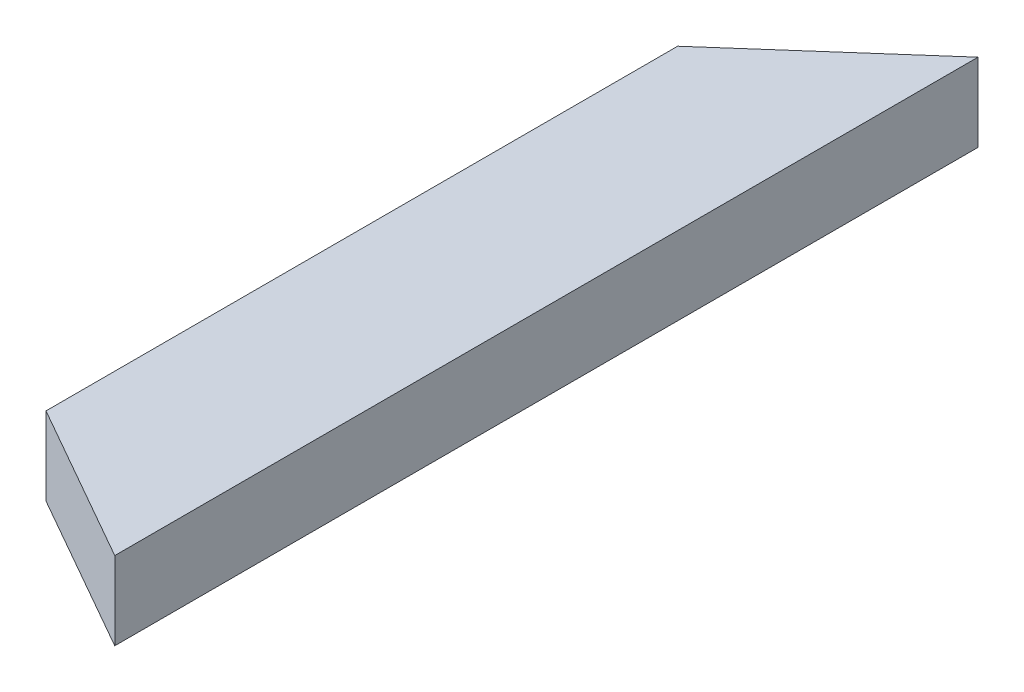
from build123d import *

# Parameters (mm, degrees)
ESQUISSE1_W             = 47
ESQUISSE1_H             = 23
BOSS_EXTRU_1_DEPTH      = 220
BOSS_EXTRU_2_DEPTH      = 23
ENL_V_MAT_EXTRU_1_DEPTH = 23


with BuildPart() as part:
    # Esquisse1 → Boss.-Extru.1 (new body)
    with BuildSketch(Plane.XY):
        Rectangle(ESQUISSE1_W, ESQUISSE1_H)
    extrude(amount=BOSS_EXTRU_1_DEPTH)

    # Esquisse2 → Boss.-Extru.2 (add)
    with BuildSketch(Plane(origin=(0, 11.5, 0), x_dir=(1, 0, 0), z_dir=(0, 1, 0))):
        with BuildLine():
            ThreePointArc((19.180088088, -220), (18.541307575, -224.908736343), (16.667514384, -229.490508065))
            Line((16.667514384, -229.490508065), (23.5, -233.380935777))
            Line((23.5, -233.380935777), (23.5, -220))
            Line((23.5, -220), (19.180088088, -220))
        make_face()
        with BuildLine():
            Line((19.180088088, -220), (0, -220))
            Line((0, -220), (16.667514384, -229.490508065))
            ThreePointArc((16.667514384, -229.490508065), (18.541307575, -224.908736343), (19.180088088, -220))
        make_face()
        with BuildLine():
            Line((23.5, 20.702513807), (15.092495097, 13.295854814))
            ThreePointArc((15.092495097, 13.295854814), (18.816613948, 7.106208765), (20.113755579, 0))
            Line((20.113755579, 0), (23.5, 0))
            Line((23.5, 0), (23.5, 20.702513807))
        make_face()
        with BuildLine():
            Line((15.092495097, 13.295854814), (0, 0))
            Line((0, 0), (20.113755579, 0))
            ThreePointArc((20.113755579, 0), (18.816613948, 7.106208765), (15.092495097, 13.295854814))
        make_face()
    extrude(amount=-BOSS_EXTRU_2_DEPTH)

    # Esquisse2_3 → Enl_v. mat.-Extru.1 (cut)
    with BuildSketch(Plane(origin=(0, 11.5, 0), x_dir=(1, 0, 0), z_dir=(0, 1, 0))):
        Polygon((-23.5, -20.702513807), (0, 0), (-23.5, 0), align=None)
        Polygon((0, -220), (-23.5, -206.619064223), (-23.5, -220), align=None)
    extrude(amount=-ENL_V_MAT_EXTRU_1_DEPTH, mode=Mode.SUBTRACT)


solid = part.part
